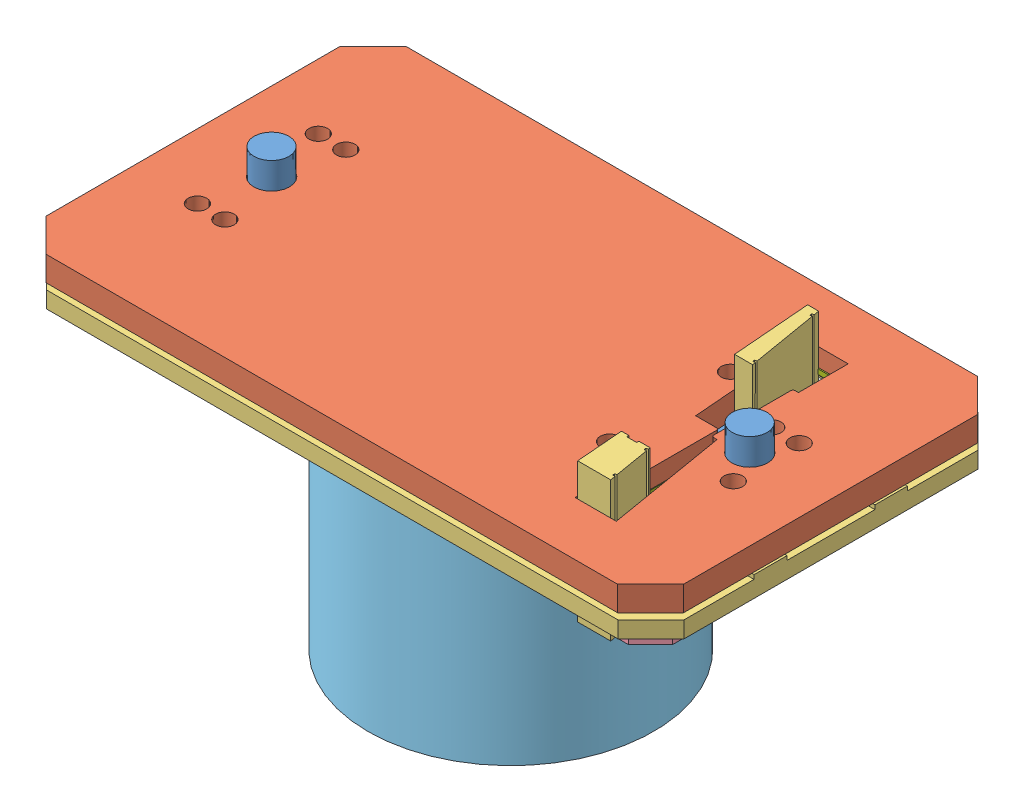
SolidWorks assembly C4D-3Dassembly10.SLDASM, configuration Default (file format 6000). Lengths in mm.
Overall size (116 58.34 65.57).
10 component instances, 7 part files, 0 mates.
Components (placement in the parent):
- chip-1: chip.SLDPRT [Default] at origin size (97 10.36 15)
- laserCut-top-2: laserCut-top.SLDPRT [Default] at (-4.8092 1.0687 -0.0257) size (116 4.5 65.5)
- holder-1: holder.SLDPRT [Default] at (-4.8069 -3.0842 -0.0977) size (116 25.4 65.5)
- laserCut-bottom-1: laserCut-bottom.SLDPRT [Default] at (-4.9024 -9.0375 -0.1049) size (104 4.5 53.5)
- wood-2: wood.SLDPRT [Default] at (0.0894 -47.0225 0.0618) size (52 38 52)
- spacer-5: spacer.SLDPRT [Default] at (-43.5211 -4.5941 0.0029) size (14.8 4.5 15.8)
- spacer-6: spacer.SLDPRT [Default] at (-23.5211 -4.5941 0.0029) size (14.8 4.5 15.8)
- spacer-7: spacer.SLDPRT [Default] at (-3.5211 -4.5941 0.0029) size (14.8 4.5 15.8)
- spacer-8: spacer.SLDPRT [Default] at (16.4789 -4.5941 0.0029) size (14.8 4.5 15.8)
- NASA-1: NASA.SLDPRT [Default] at (-5.0845 1.3677 0.0993) size (16.75 1.3 46.45)
